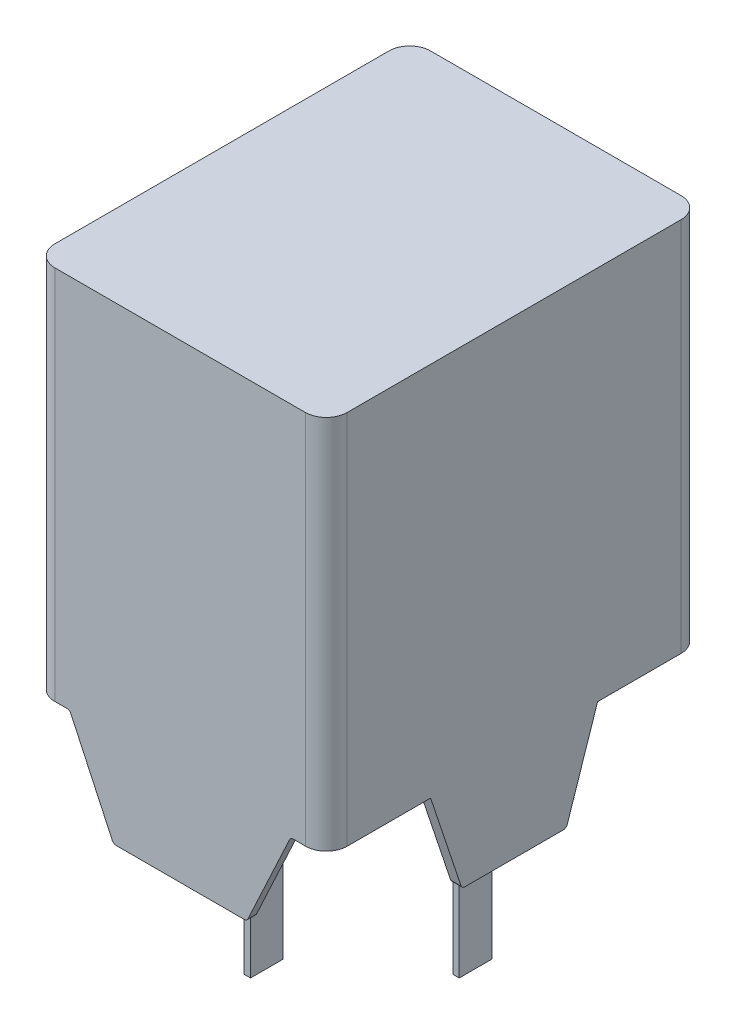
ISO-10303-21;
HEADER;
FILE_DESCRIPTION(('STEP AP214'),'2;1');
FILE_NAME('part.step','',(''),(''),'','','');
FILE_SCHEMA(('AUTOMOTIVE_DESIGN { 1 0 10303 214 1 1 1 1 }'));
ENDSEC;
DATA;
#1=APPLICATION_CONTEXT('core data for automotive mechanical design processes');
#2=APPLICATION_PROTOCOL_DEFINITION('international standard','automotive_design',2000,#1);
#3=PRODUCT_CONTEXT('',#1,'mechanical');
#4=PRODUCT('Part','Part','',(#3));
#5=PRODUCT_RELATED_PRODUCT_CATEGORY('part','',(#4));
#6=PRODUCT_DEFINITION_FORMATION('','',#4);
#7=PRODUCT_DEFINITION_CONTEXT('part definition',#1,'design');
#8=PRODUCT_DEFINITION('design','',#6,#7);
#9=PRODUCT_DEFINITION_SHAPE('','',#8);
#10=(LENGTH_UNIT() NAMED_UNIT(*) SI_UNIT(.MILLI.,.METRE.));
#11=(NAMED_UNIT(*) PLANE_ANGLE_UNIT() SI_UNIT($,.RADIAN.));
#12=(NAMED_UNIT(*) SI_UNIT($,.STERADIAN.) SOLID_ANGLE_UNIT());
#13=UNCERTAINTY_MEASURE_WITH_UNIT(LENGTH_MEASURE(1.E-05),#10,'distance_accuracy_value','');
#14=(GEOMETRIC_REPRESENTATION_CONTEXT(3) GLOBAL_UNCERTAINTY_ASSIGNED_CONTEXT((#13)) GLOBAL_UNIT_ASSIGNED_CONTEXT((#10,
#11,#12)) REPRESENTATION_CONTEXT('',''));
#15=CARTESIAN_POINT('',(0.,0.,0.));
#16=DIRECTION('',(0.,0.,1.));
#17=DIRECTION('',(1.,0.,0.));
#18=AXIS2_PLACEMENT_3D('',#15,#16,#17);
#19=CARTESIAN_POINT('',(7.,-6.75,15.));
#20=DIRECTION('',(0.,1.,0.));
#21=DIRECTION('',(0.,0.,1.));
#22=AXIS2_PLACEMENT_3D('',#19,#20,#21);
#23=PLANE('',#22);
#24=DIRECTION('',(0.,0.,-1.));
#25=VECTOR('',#24,1.);
#26=CARTESIAN_POINT('',(-5.15,-6.75,9.77948756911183));
#27=LINE('',#26,#25);
#28=CARTESIAN_POINT('',(-5.15,-6.75,9.77948756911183));
#29=VERTEX_POINT('',#28);
#30=CARTESIAN_POINT('',(-5.15,-6.75,8.22051243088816));
#31=VERTEX_POINT('',#30);
#32=EDGE_CURVE('E370',#29,#31,#27,.T.);
#33=ORIENTED_EDGE('',*,*,#32,.F.);
#34=DIRECTION('',(-1.,0.,0.));
#35=VECTOR('',#34,1.);
#36=CARTESIAN_POINT('',(-4.85,-6.75,9.77948756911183));
#37=LINE('',#36,#35);
#38=CARTESIAN_POINT('',(-4.85,-6.75,9.77948756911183));
#39=VERTEX_POINT('',#38);
#40=EDGE_CURVE('E360',#39,#29,#37,.T.);
#41=ORIENTED_EDGE('',*,*,#40,.F.);
#42=DIRECTION('',(0.,0.,1.));
#43=VECTOR('',#42,1.);
#44=CARTESIAN_POINT('',(-4.85,-6.75,9.77948756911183));
#45=LINE('',#44,#43);
#46=CARTESIAN_POINT('',(-4.85,-6.75,8.22051243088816));
#47=VERTEX_POINT('',#46);
#48=EDGE_CURVE('E363',#47,#39,#45,.T.);
#49=ORIENTED_EDGE('',*,*,#48,.F.);
#50=DIRECTION('',(1.,0.,0.));
#51=VECTOR('',#50,1.);
#52=CARTESIAN_POINT('',(-4.85,-6.75,8.22051243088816));
#53=LINE('',#52,#51);
#54=EDGE_CURVE('E367',#31,#47,#53,.T.);
#55=ORIENTED_EDGE('',*,*,#54,.F.);
#56=EDGE_LOOP('',(#33,#41,#49,#55));
#57=FACE_BOUND('',#56,.T.);
#58=DIRECTION('',(-1.,0.,0.));
#59=VECTOR('',#58,1.);
#60=CARTESIAN_POINT('',(7.,-6.75,0.));
#61=LINE('',#60,#59);
#62=CARTESIAN_POINT('',(6.,-6.75,0.));
#63=VERTEX_POINT('',#62);
#64=CARTESIAN_POINT('',(-6.,-6.75,0.));
#65=VERTEX_POINT('',#64);
#66=EDGE_CURVE('E452',#63,#65,#61,.T.);
#67=ORIENTED_EDGE('',*,*,#66,.F.);
#68=CARTESIAN_POINT('',(6.,-6.75,1.));
#69=DIRECTION('',(0.,1.,0.));
#70=DIRECTION('',(0.,0.,1.));
#71=AXIS2_PLACEMENT_3D('',#68,#69,#70);
#72=CIRCLE('',#71,1.);
#73=CARTESIAN_POINT('',(7.,-6.74999999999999,1.));
#74=VERTEX_POINT('',#73);
#75=EDGE_CURVE('E623',#63,#74,#72,.F.);
#76=ORIENTED_EDGE('',*,*,#75,.T.);
#77=DIRECTION('',(0.,0.,-1.));
#78=VECTOR('',#77,1.);
#79=CARTESIAN_POINT('',(7.,-6.74999999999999,0.));
#80=LINE('',#79,#78);
#81=CARTESIAN_POINT('',(7.,-6.74999999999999,5.));
#82=VERTEX_POINT('',#81);
#83=EDGE_CURVE('E439',#82,#74,#80,.T.);
#84=ORIENTED_EDGE('',*,*,#83,.F.);
#85=DIRECTION('',(-1.,0.,0.));
#86=VECTOR('',#85,1.);
#87=CARTESIAN_POINT('',(7.,-6.74999999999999,5.));
#88=LINE('',#87,#86);
#89=CARTESIAN_POINT('',(6.5,-6.74999999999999,5.));
#90=VERTEX_POINT('',#89);
#91=EDGE_CURVE('E456',#82,#90,#88,.T.);
#92=ORIENTED_EDGE('',*,*,#91,.T.);
#93=DIRECTION('',(0.,0.,-1.));
#94=VECTOR('',#93,1.);
#95=CARTESIAN_POINT('',(6.5,-6.74999999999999,17.5));
#96=LINE('',#95,#94);
#97=CARTESIAN_POINT('',(6.5,-6.74999999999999,12.9999999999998));
#98=VERTEX_POINT('',#97);
#99=EDGE_CURVE('E412',#98,#90,#96,.T.);
#100=ORIENTED_EDGE('',*,*,#99,.F.);
#101=DIRECTION('',(-1.,0.,0.));
#102=VECTOR('',#101,1.);
#103=CARTESIAN_POINT('',(7.,-6.75,12.9999999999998));
#104=LINE('',#103,#102);
#105=CARTESIAN_POINT('',(7.,-6.75,12.9999999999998));
#106=VERTEX_POINT('',#105);
#107=EDGE_CURVE('E487',#106,#98,#104,.T.);
#108=ORIENTED_EDGE('',*,*,#107,.F.);
#109=DIRECTION('',(0.,0.,-1.));
#110=VECTOR('',#109,1.);
#111=CARTESIAN_POINT('',(7.,-6.74999999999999,0.));
#112=LINE('',#111,#110);
#113=CARTESIAN_POINT('',(7.,-6.75,15.));
#114=VERTEX_POINT('',#113);
#115=EDGE_CURVE('E469',#114,#106,#112,.T.);
#116=ORIENTED_EDGE('',*,*,#115,.F.);
#117=DIRECTION('',(-1.,0.,0.));
#118=VECTOR('',#117,1.);
#119=CARTESIAN_POINT('',(7.,-6.75,15.));
#120=LINE('',#119,#118);
#121=CARTESIAN_POINT('',(5.35595267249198,-6.75,15.));
#122=VERTEX_POINT('',#121);
#123=EDGE_CURVE('E491',#114,#122,#120,.T.);
#124=ORIENTED_EDGE('',*,*,#123,.T.);
#125=DIRECTION('',(0.,0.,1.));
#126=VECTOR('',#125,1.);
#127=CARTESIAN_POINT('',(5.35595267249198,-6.75,15.));
#128=LINE('',#127,#126);
#129=CARTESIAN_POINT('',(5.35595267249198,-6.75,17.5865817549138));
#130=VERTEX_POINT('',#129);
#131=EDGE_CURVE('E503',#122,#130,#128,.T.);
#132=ORIENTED_EDGE('',*,*,#131,.T.);
#133=DIRECTION('',(-1.,0.,0.));
#134=VECTOR('',#133,1.);
#135=CARTESIAN_POINT('',(7.,-6.75,17.5865817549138));
#136=LINE('',#135,#134);
#137=CARTESIAN_POINT('',(-5.35595267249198,-6.75,17.5865817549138));
#138=VERTEX_POINT('',#137);
#139=EDGE_CURVE('E497',#130,#138,#136,.T.);
#140=ORIENTED_EDGE('',*,*,#139,.T.);
#141=DIRECTION('',(0.,0.,1.));
#142=VECTOR('',#141,1.);
#143=CARTESIAN_POINT('',(-5.35595267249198,-6.75,15.));
#144=LINE('',#143,#142);
#145=CARTESIAN_POINT('',(-5.35595267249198,-6.75,15.));
#146=VERTEX_POINT('',#145);
#147=EDGE_CURVE('E500',#138,#146,#144,.F.);
#148=ORIENTED_EDGE('',*,*,#147,.T.);
#149=CARTESIAN_POINT('',(-7.,-6.75,15.));
#150=VERTEX_POINT('',#149);
#151=EDGE_CURVE('E493',#146,#150,#120,.T.);
#152=ORIENTED_EDGE('',*,*,#151,.T.);
#153=DIRECTION('',(0.,0.,-1.));
#154=VECTOR('',#153,1.);
#155=CARTESIAN_POINT('',(-7.,-6.74999999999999,0.));
#156=LINE('',#155,#154);
#157=CARTESIAN_POINT('',(-7.,-6.75,12.9999999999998));
#158=VERTEX_POINT('',#157);
#159=EDGE_CURVE('E479',#150,#158,#156,.T.);
#160=ORIENTED_EDGE('',*,*,#159,.T.);
#161=CARTESIAN_POINT('',(-6.5,-6.74999999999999,12.9999999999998));
#162=VERTEX_POINT('',#161);
#163=EDGE_CURVE('E490',#162,#158,#104,.T.);
#164=ORIENTED_EDGE('',*,*,#163,.F.);
#165=DIRECTION('',(0.,0.,-1.));
#166=VECTOR('',#165,1.);
#167=CARTESIAN_POINT('',(-6.5,-6.74999999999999,17.5));
#168=LINE('',#167,#166);
#169=CARTESIAN_POINT('',(-6.5,-6.75,5.));
#170=VERTEX_POINT('',#169);
#171=EDGE_CURVE('E415',#162,#170,#168,.T.);
#172=ORIENTED_EDGE('',*,*,#171,.T.);
#173=CARTESIAN_POINT('',(-7.,-6.74999999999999,5.));
#174=VERTEX_POINT('',#173);
#175=EDGE_CURVE('E459',#170,#174,#88,.T.);
#176=ORIENTED_EDGE('',*,*,#175,.T.);
#177=DIRECTION('',(0.,0.,-1.));
#178=VECTOR('',#177,1.);
#179=CARTESIAN_POINT('',(-7.,-6.74999999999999,0.));
#180=LINE('',#179,#178);
#181=CARTESIAN_POINT('',(-7.,-6.74999999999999,1.));
#182=VERTEX_POINT('',#181);
#183=EDGE_CURVE('E437',#174,#182,#180,.T.);
#184=ORIENTED_EDGE('',*,*,#183,.T.);
#185=CARTESIAN_POINT('',(-6.,-6.75,1.));
#186=DIRECTION('',(0.,1.,0.));
#187=DIRECTION('',(0.,0.,1.));
#188=AXIS2_PLACEMENT_3D('',#185,#186,#187);
#189=CIRCLE('',#188,1.);
#190=EDGE_CURVE('E621',#182,#65,#189,.F.);
#191=ORIENTED_EDGE('',*,*,#190,.T.);
#192=EDGE_LOOP('',(#67,#76,#84,#92,#100,#108,#116,#124,#132,#140,#148,#152,#160,#164,#172,#176,
#184,#191));
#193=FACE_BOUND('',#192,.T.);
#194=DIRECTION('',(0.,0.,-1.));
#195=VECTOR('',#194,1.);
#196=CARTESIAN_POINT('',(4.85,-6.75,9.77948756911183));
#197=LINE('',#196,#195);
#198=CARTESIAN_POINT('',(4.85,-6.75,9.77948756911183));
#199=VERTEX_POINT('',#198);
#200=CARTESIAN_POINT('',(4.85,-6.75,8.22051243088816));
#201=VERTEX_POINT('',#200);
#202=EDGE_CURVE('E350',#199,#201,#197,.T.);
#203=ORIENTED_EDGE('',*,*,#202,.F.);
#204=DIRECTION('',(-1.,0.,0.));
#205=VECTOR('',#204,1.);
#206=CARTESIAN_POINT('',(5.15,-6.75,9.77948756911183));
#207=LINE('',#206,#205);
#208=CARTESIAN_POINT('',(5.15,-6.75,9.77948756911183));
#209=VERTEX_POINT('',#208);
#210=EDGE_CURVE('E393',#209,#199,#207,.T.);
#211=ORIENTED_EDGE('',*,*,#210,.F.);
#212=DIRECTION('',(0.,0.,1.));
#213=VECTOR('',#212,1.);
#214=CARTESIAN_POINT('',(5.15,-6.75,9.77948756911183));
#215=LINE('',#214,#213);
#216=CARTESIAN_POINT('',(5.15,-6.75,8.22051243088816));
#217=VERTEX_POINT('',#216);
#218=EDGE_CURVE('E396',#217,#209,#215,.T.);
#219=ORIENTED_EDGE('',*,*,#218,.F.);
#220=DIRECTION('',(1.,0.,0.));
#221=VECTOR('',#220,1.);
#222=CARTESIAN_POINT('',(5.15,-6.75,8.22051243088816));
#223=LINE('',#222,#221);
#224=EDGE_CURVE('E400',#201,#217,#223,.T.);
#225=ORIENTED_EDGE('',*,*,#224,.F.);
#226=EDGE_LOOP('',(#203,#211,#219,#225));
#227=FACE_BOUND('',#226,.T.);
#228=DIRECTION('',(0.,0.,-1.));
#229=VECTOR('',#228,1.);
#230=CARTESIAN_POINT('',(-0.15,-6.75,14.7794875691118));
#231=LINE('',#230,#229);
#232=CARTESIAN_POINT('',(-0.15,-6.75,14.7794875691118));
#233=VERTEX_POINT('',#232);
#234=CARTESIAN_POINT('',(-0.15,-6.75,13.2205124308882));
#235=VERTEX_POINT('',#234);
#236=EDGE_CURVE('E336',#233,#235,#231,.T.);
#237=ORIENTED_EDGE('',*,*,#236,.F.);
#238=DIRECTION('',(-1.,0.,0.));
#239=VECTOR('',#238,1.);
#240=CARTESIAN_POINT('',(0.15,-6.75,14.7794875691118));
#241=LINE('',#240,#239);
#242=CARTESIAN_POINT('',(0.150000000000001,-6.75,14.7794875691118));
#243=VERTEX_POINT('',#242);
#244=EDGE_CURVE('E333',#243,#233,#241,.T.);
#245=ORIENTED_EDGE('',*,*,#244,.F.);
#246=DIRECTION('',(0.,0.,1.));
#247=VECTOR('',#246,1.);
#248=CARTESIAN_POINT('',(0.15,-6.75,14.7794875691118));
#249=LINE('',#248,#247);
#250=CARTESIAN_POINT('',(0.15,-6.75,13.2205124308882));
#251=VERTEX_POINT('',#250);
#252=EDGE_CURVE('E62',#251,#243,#249,.T.);
#253=ORIENTED_EDGE('',*,*,#252,.F.);
#254=DIRECTION('',(1.,0.,0.));
#255=VECTOR('',#254,1.);
#256=CARTESIAN_POINT('',(0.15,-6.75,13.2205124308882));
#257=LINE('',#256,#255);
#258=EDGE_CURVE('E57',#235,#251,#257,.T.);
#259=ORIENTED_EDGE('',*,*,#258,.F.);
#260=EDGE_LOOP('',(#237,#245,#253,#259));
#261=FACE_BOUND('',#260,.T.);
#262=ADVANCED_FACE('F42',(#57,#193,#227,#261),#23,.F.);
#263=CARTESIAN_POINT('',(-7.,-11.25,18.));
#264=DIRECTION('',(0.,1.,0.));
#265=DIRECTION('',(0.,0.,1.));
#266=AXIS2_PLACEMENT_3D('',#263,#264,#265);
#267=PLANE('',#266);
#268=DIRECTION('',(-1.,0.,0.));
#269=VECTOR('',#268,1.);
#270=CARTESIAN_POINT('',(7.,-11.25,11.3558481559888));
#271=LINE('',#270,#269);
#272=CARTESIAN_POINT('',(7.,-11.25,11.3558481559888));
#273=VERTEX_POINT('',#272);
#274=CARTESIAN_POINT('',(6.5,-11.25,11.3558481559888));
#275=VERTEX_POINT('',#274);
#276=EDGE_CURVE('E494',#273,#275,#271,.T.);
#277=ORIENTED_EDGE('',*,*,#276,.T.);
#278=DIRECTION('',(0.,0.,-1.));
#279=VECTOR('',#278,1.);
#280=CARTESIAN_POINT('',(6.5,-11.25,17.5));
#281=LINE('',#280,#279);
#282=CARTESIAN_POINT('',(6.5,-11.25,6.64415184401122));
#283=VERTEX_POINT('',#282);
#284=EDGE_CURVE('E337',#275,#283,#281,.T.);
#285=ORIENTED_EDGE('',*,*,#284,.T.);
#286=DIRECTION('',(-1.,0.,0.));
#287=VECTOR('',#286,1.);
#288=CARTESIAN_POINT('',(7.,-11.25,6.64415184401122));
#289=LINE('',#288,#287);
#290=CARTESIAN_POINT('',(7.,-11.25,6.64415184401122));
#291=VERTEX_POINT('',#290);
#292=EDGE_CURVE('E464',#291,#283,#289,.T.);
#293=ORIENTED_EDGE('',*,*,#292,.F.);
#294=DIRECTION('',(0.,0.,-1.));
#295=VECTOR('',#294,1.);
#296=CARTESIAN_POINT('',(7.,-11.25,18.));
#297=LINE('',#296,#295);
#298=EDGE_CURVE('E581',#273,#291,#297,.T.);
#299=ORIENTED_EDGE('',*,*,#298,.F.);
#300=EDGE_LOOP('',(#277,#285,#293,#299));
#301=FACE_BOUND('',#300,.T.);
#302=ADVANCED_FACE('F738',(#301),#267,.F.);
#303=CARTESIAN_POINT('',(7.,-11.05,11.3558481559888));
#304=DIRECTION('',(-1.,0.,0.));
#305=DIRECTION('',(0.,0.,1.));
#306=AXIS2_PLACEMENT_3D('',#303,#304,#305);
#307=CYLINDRICAL_SURFACE('',#306,0.2);
#308=CARTESIAN_POINT('',(6.5,-11.05,11.3558481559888));
#309=DIRECTION('',(1.,0.,0.));
#310=DIRECTION('',(0.,1.,0.));
#311=AXIS2_PLACEMENT_3D('',#308,#309,#310);
#312=CIRCLE('',#311,0.2);
#313=CARTESIAN_POINT('',(6.5,-11.1132455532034,11.5455848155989));
#314=VERTEX_POINT('',#313);
#315=EDGE_CURVE('E430',#275,#314,#312,.F.);
#316=ORIENTED_EDGE('',*,*,#315,.F.);
#317=ORIENTED_EDGE('',*,*,#276,.F.);
#318=CARTESIAN_POINT('',(7.,-11.05,11.3558481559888));
#319=DIRECTION('',(-1.,0.,0.));
#320=DIRECTION('',(0.,0.,1.));
#321=AXIS2_PLACEMENT_3D('',#318,#319,#320);
#322=CIRCLE('',#321,0.2);
#323=CARTESIAN_POINT('',(7.,-11.1132455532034,11.5455848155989));
#324=VERTEX_POINT('',#323);
#325=EDGE_CURVE('E467',#273,#324,#322,.T.);
#326=ORIENTED_EDGE('',*,*,#325,.T.);
#327=DIRECTION('',(-1.,0.,0.));
#328=VECTOR('',#327,1.);
#329=CARTESIAN_POINT('',(7.,-11.1132455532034,11.5455848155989));
#330=LINE('',#329,#328);
#331=EDGE_CURVE('E447',#324,#314,#330,.T.);
#332=ORIENTED_EDGE('',*,*,#331,.T.);
#333=EDGE_LOOP('',(#316,#317,#326,#332));
#334=FACE_BOUND('',#333,.T.);
#335=ADVANCED_FACE('F734',(#334),#307,.T.);
#336=CARTESIAN_POINT('',(7.,-4.57499999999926,13.7249999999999));
#337=DIRECTION('',(0.,0.316227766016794,-0.948683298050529));
#338=DIRECTION('',(0.,0.948683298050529,0.316227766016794));
#339=AXIS2_PLACEMENT_3D('',#336,#337,#338);
#340=PLANE('',#339);
#341=ORIENTED_EDGE('',*,*,#107,.T.);
#342=DIRECTION('',(0.,-0.948683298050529,-0.316227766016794));
#343=VECTOR('',#342,1.);
#344=CARTESIAN_POINT('',(6.5,-4.57499999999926,13.7249999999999));
#345=LINE('',#344,#343);
#346=EDGE_CURVE('E427',#98,#314,#345,.T.);
#347=ORIENTED_EDGE('',*,*,#346,.T.);
#348=ORIENTED_EDGE('',*,*,#331,.F.);
#349=DIRECTION('',(0.,-0.948683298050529,-0.316227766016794));
#350=VECTOR('',#349,1.);
#351=CARTESIAN_POINT('',(7.,-4.57499999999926,13.7249999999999));
#352=LINE('',#351,#350);
#353=EDGE_CURVE('E473',#106,#324,#352,.T.);
#354=ORIENTED_EDGE('',*,*,#353,.F.);
#355=EDGE_LOOP('',(#341,#347,#348,#354));
#356=FACE_BOUND('',#355,.T.);
#357=ADVANCED_FACE('F731',(#356),#340,.F.);
#358=CARTESIAN_POINT('',(7.,0.825,2.475));
#359=DIRECTION('',(0.,-0.316227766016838,-0.948683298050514));
#360=DIRECTION('',(0.,0.948683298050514,-0.316227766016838));
#361=AXIS2_PLACEMENT_3D('',#358,#359,#360);
#362=PLANE('',#361);
#363=DIRECTION('',(0.,-0.948683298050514,0.316227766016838));
#364=VECTOR('',#363,1.);
#365=CARTESIAN_POINT('',(6.5,0.825,2.475));
#366=LINE('',#365,#364);
#367=CARTESIAN_POINT('',(6.5,-11.1132455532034,6.45441518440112));
#368=VERTEX_POINT('',#367);
#369=EDGE_CURVE('E425',#90,#368,#366,.T.);
#370=ORIENTED_EDGE('',*,*,#369,.F.);
#371=ORIENTED_EDGE('',*,*,#91,.F.);
#372=DIRECTION('',(0.,-0.948683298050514,0.316227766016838));
#373=VECTOR('',#372,1.);
#374=CARTESIAN_POINT('',(7.,0.825,2.475));
#375=LINE('',#374,#373);
#376=CARTESIAN_POINT('',(7.,-11.1132455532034,6.45441518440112));
#377=VERTEX_POINT('',#376);
#378=EDGE_CURVE('E436',#82,#377,#375,.T.);
#379=ORIENTED_EDGE('',*,*,#378,.T.);
#380=DIRECTION('',(-1.,0.,0.));
#381=VECTOR('',#380,1.);
#382=CARTESIAN_POINT('',(7.,-11.1132455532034,6.45441518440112));
#383=LINE('',#382,#381);
#384=EDGE_CURVE('E460',#377,#368,#383,.T.);
#385=ORIENTED_EDGE('',*,*,#384,.T.);
#386=EDGE_LOOP('',(#370,#371,#379,#385));
#387=FACE_BOUND('',#386,.T.);
#388=ADVANCED_FACE('F744',(#387),#362,.T.);
#389=CARTESIAN_POINT('',(7.,-11.05,6.64415184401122));
#390=DIRECTION('',(-1.,0.,0.));
#391=DIRECTION('',(0.,0.,1.));
#392=AXIS2_PLACEMENT_3D('',#389,#390,#391);
#393=CYLINDRICAL_SURFACE('',#392,0.2);
#394=ORIENTED_EDGE('',*,*,#292,.T.);
#395=CARTESIAN_POINT('',(6.5,-11.05,6.64415184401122));
#396=DIRECTION('',(1.,0.,0.));
#397=DIRECTION('',(0.,1.,0.));
#398=AXIS2_PLACEMENT_3D('',#395,#396,#397);
#399=CIRCLE('',#398,0.2);
#400=EDGE_CURVE('E601',#283,#368,#399,.T.);
#401=ORIENTED_EDGE('',*,*,#400,.T.);
#402=ORIENTED_EDGE('',*,*,#384,.F.);
#403=CARTESIAN_POINT('',(7.,-11.05,6.64415184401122));
#404=DIRECTION('',(-1.,0.,0.));
#405=DIRECTION('',(0.,0.,1.));
#406=AXIS2_PLACEMENT_3D('',#403,#404,#405);
#407=CIRCLE('',#406,0.2);
#408=EDGE_CURVE('E433',#291,#377,#407,.F.);
#409=ORIENTED_EDGE('',*,*,#408,.F.);
#410=EDGE_LOOP('',(#394,#401,#402,#409));
#411=FACE_BOUND('',#410,.T.);
#412=ADVANCED_FACE('F740',(#411),#393,.T.);
#413=CARTESIAN_POINT('',(7.,-11.25,18.));
#414=DIRECTION('',(-1.,0.,0.));
#415=DIRECTION('',(0.,0.,1.));
#416=AXIS2_PLACEMENT_3D('',#413,#414,#415);
#417=PLANE('',#416);
#418=ORIENTED_EDGE('',*,*,#83,.T.);
#419=DIRECTION('',(0.,1.,0.));
#420=VECTOR('',#419,1.);
#421=CARTESIAN_POINT('',(7.,11.25,1.));
#422=LINE('',#421,#420);
#423=CARTESIAN_POINT('',(7.,11.25,1.));
#424=VERTEX_POINT('',#423);
#425=EDGE_CURVE('E606',#74,#424,#422,.T.);
#426=ORIENTED_EDGE('',*,*,#425,.T.);
#427=DIRECTION('',(0.,0.,-1.));
#428=VECTOR('',#427,1.);
#429=CARTESIAN_POINT('',(7.,11.25,18.));
#430=LINE('',#429,#428);
#431=CARTESIAN_POINT('',(7.,11.25,17.));
#432=VERTEX_POINT('',#431);
#433=EDGE_CURVE('E592',#432,#424,#430,.T.);
#434=ORIENTED_EDGE('',*,*,#433,.F.);
#435=DIRECTION('',(0.,1.,0.));
#436=VECTOR('',#435,1.);
#437=CARTESIAN_POINT('',(7.,-11.25,17.));
#438=LINE('',#437,#436);
#439=CARTESIAN_POINT('',(7.,-6.75,17.));
#440=VERTEX_POINT('',#439);
#441=EDGE_CURVE('E604',#432,#440,#438,.F.);
#442=ORIENTED_EDGE('',*,*,#441,.T.);
#443=DIRECTION('',(0.,0.,1.));
#444=VECTOR('',#443,1.);
#445=CARTESIAN_POINT('',(7.,-6.75,15.));
#446=LINE('',#445,#444);
#447=EDGE_CURVE('E567',#114,#440,#446,.T.);
#448=ORIENTED_EDGE('',*,*,#447,.F.);
#449=ORIENTED_EDGE('',*,*,#115,.T.);
#450=ORIENTED_EDGE('',*,*,#353,.T.);
#451=ORIENTED_EDGE('',*,*,#325,.F.);
#452=ORIENTED_EDGE('',*,*,#298,.T.);
#453=ORIENTED_EDGE('',*,*,#408,.T.);
#454=ORIENTED_EDGE('',*,*,#378,.F.);
#455=EDGE_LOOP('',(#418,#426,#434,#442,#448,#449,#450,#451,#452,#453,#454));
#456=FACE_BOUND('',#455,.T.);
#457=ADVANCED_FACE('F704',(#456),#417,.F.);
#458=CARTESIAN_POINT('',(-7.,-11.25,18.));
#459=DIRECTION('',(1.,0.,0.));
#460=DIRECTION('',(0.,0.,-1.));
#461=AXIS2_PLACEMENT_3D('',#458,#459,#460);
#462=PLANE('',#461);
#463=DIRECTION('',(0.,0.,1.));
#464=VECTOR('',#463,1.);
#465=CARTESIAN_POINT('',(-7.,-6.75,15.));
#466=LINE('',#465,#464);
#467=CARTESIAN_POINT('',(-7.,-6.75,17.));
#468=VERTEX_POINT('',#467);
#469=EDGE_CURVE('E543',#150,#468,#466,.T.);
#470=ORIENTED_EDGE('',*,*,#469,.T.);
#471=DIRECTION('',(0.,-1.,0.));
#472=VECTOR('',#471,1.);
#473=CARTESIAN_POINT('',(-7.,-11.25,17.));
#474=LINE('',#473,#472);
#475=CARTESIAN_POINT('',(-7.,11.25,17.));
#476=VERTEX_POINT('',#475);
#477=EDGE_CURVE('E12',#468,#476,#474,.F.);
#478=ORIENTED_EDGE('',*,*,#477,.T.);
#479=DIRECTION('',(0.,0.,-1.));
#480=VECTOR('',#479,1.);
#481=CARTESIAN_POINT('',(-7.,11.25,18.));
#482=LINE('',#481,#480);
#483=CARTESIAN_POINT('',(-7.,11.25,1.));
#484=VERTEX_POINT('',#483);
#485=EDGE_CURVE('E589',#476,#484,#482,.T.);
#486=ORIENTED_EDGE('',*,*,#485,.T.);
#487=DIRECTION('',(0.,-1.,0.));
#488=VECTOR('',#487,1.);
#489=CARTESIAN_POINT('',(-7.,-6.75,1.));
#490=LINE('',#489,#488);
#491=EDGE_CURVE('E50',#484,#182,#490,.T.);
#492=ORIENTED_EDGE('',*,*,#491,.T.);
#493=ORIENTED_EDGE('',*,*,#183,.F.);
#494=DIRECTION('',(0.,-0.948683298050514,0.316227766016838));
#495=VECTOR('',#494,1.);
#496=CARTESIAN_POINT('',(-7.,0.825,2.475));
#497=LINE('',#496,#495);
#498=CARTESIAN_POINT('',(-7.,-11.1132455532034,6.45441518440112));
#499=VERTEX_POINT('',#498);
#500=EDGE_CURVE('E446',#174,#499,#497,.T.);
#501=ORIENTED_EDGE('',*,*,#500,.T.);
#502=CARTESIAN_POINT('',(-7.,-11.05,6.64415184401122));
#503=DIRECTION('',(-1.,0.,0.));
#504=DIRECTION('',(0.,0.,1.));
#505=AXIS2_PLACEMENT_3D('',#502,#503,#504);
#506=CIRCLE('',#505,0.2);
#507=CARTESIAN_POINT('',(-7.,-11.25,6.64415184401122));
#508=VERTEX_POINT('',#507);
#509=EDGE_CURVE('E443',#508,#499,#506,.F.);
#510=ORIENTED_EDGE('',*,*,#509,.F.);
#511=DIRECTION('',(0.,0.,-1.));
#512=VECTOR('',#511,1.);
#513=CARTESIAN_POINT('',(-7.,-11.25,18.));
#514=LINE('',#513,#512);
#515=CARTESIAN_POINT('',(-7.,-11.25,11.3558481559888));
#516=VERTEX_POINT('',#515);
#517=EDGE_CURVE('E586',#516,#508,#514,.T.);
#518=ORIENTED_EDGE('',*,*,#517,.F.);
#519=CARTESIAN_POINT('',(-7.,-11.05,11.3558481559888));
#520=DIRECTION('',(-1.,0.,0.));
#521=DIRECTION('',(0.,0.,1.));
#522=AXIS2_PLACEMENT_3D('',#519,#520,#521);
#523=CIRCLE('',#522,0.2);
#524=CARTESIAN_POINT('',(-7.,-11.1132455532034,11.5455848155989));
#525=VERTEX_POINT('',#524);
#526=EDGE_CURVE('E432',#516,#525,#523,.T.);
#527=ORIENTED_EDGE('',*,*,#526,.T.);
#528=DIRECTION('',(0.,-0.948683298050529,-0.316227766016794));
#529=VECTOR('',#528,1.);
#530=CARTESIAN_POINT('',(-7.,-4.57499999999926,13.7249999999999));
#531=LINE('',#530,#529);
#532=EDGE_CURVE('E470',#158,#525,#531,.T.);
#533=ORIENTED_EDGE('',*,*,#532,.F.);
#534=ORIENTED_EDGE('',*,*,#159,.F.);
#535=EDGE_LOOP('',(#470,#478,#486,#492,#493,#501,#510,#518,#527,#533,#534));
#536=FACE_BOUND('',#535,.T.);
#537=ADVANCED_FACE('F638',(#536),#462,.F.);
#538=CARTESIAN_POINT('',(0.,0.,15.));
#539=DIRECTION('',(0.,0.,1.));
#540=DIRECTION('',(1.,0.,0.));
#541=AXIS2_PLACEMENT_3D('',#538,#539,#540);
#542=PLANE('',#541);
#543=ORIENTED_EDGE('',*,*,#123,.F.);
#544=DIRECTION('',(0.999975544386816,-0.00699361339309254,0.));
#545=VECTOR('',#544,1.);
#546=CARTESIAN_POINT('',(-0.046863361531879,-6.70071575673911,15.));
#547=LINE('',#546,#545);
#548=CARTESIAN_POINT('',(5.42286656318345,-6.73896986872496,15.));
#549=VERTEX_POINT('',#548);
#550=EDGE_CURVE('E550',#549,#114,#547,.T.);
#551=ORIENTED_EDGE('',*,*,#550,.F.);
#552=CARTESIAN_POINT('',(5.42146784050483,-6.93896497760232,15.));
#553=DIRECTION('',(0.,0.,1.));
#554=DIRECTION('',(1.,0.,0.));
#555=AXIS2_PLACEMENT_3D('',#552,#553,#554);
#556=CIRCLE('',#555,0.2);
#557=EDGE_CURVE('E548',#122,#549,#556,.F.);
#558=ORIENTED_EDGE('',*,*,#557,.F.);
#559=EDGE_LOOP('',(#543,#551,#558));
#560=FACE_BOUND('',#559,.T.);
#561=ADVANCED_FACE('F724',(#560),#542,.T.);
#562=CARTESIAN_POINT('',(-6.5,-11.25,6.64415184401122));
#563=VERTEX_POINT('',#562);
#564=EDGE_CURVE('E442',#563,#508,#289,.T.);
#565=ORIENTED_EDGE('',*,*,#564,.F.);
#566=DIRECTION('',(0.,0.,-1.));
#567=VECTOR('',#566,1.);
#568=CARTESIAN_POINT('',(-6.5,-11.25,17.5));
#569=LINE('',#568,#567);
#570=CARTESIAN_POINT('',(-6.5,-11.25,11.3558481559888));
#571=VERTEX_POINT('',#570);
#572=EDGE_CURVE('E340',#571,#563,#569,.T.);
#573=ORIENTED_EDGE('',*,*,#572,.F.);
#574=EDGE_CURVE('E476',#571,#516,#271,.T.);
#575=ORIENTED_EDGE('',*,*,#574,.T.);
#576=ORIENTED_EDGE('',*,*,#517,.T.);
#577=EDGE_LOOP('',(#565,#573,#575,#576));
#578=FACE_BOUND('',#577,.T.);
#579=ADVANCED_FACE('F657',(#578),#267,.F.);
#580=CARTESIAN_POINT('',(0.,0.,18.));
#581=DIRECTION('',(0.,0.,-1.));
#582=DIRECTION('',(-1.,0.,0.));
#583=AXIS2_PLACEMENT_3D('',#580,#581,#582);
#584=PLANE('',#583);
#585=DIRECTION('',(0.999975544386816,-0.00699361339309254,0.));
#586=VECTOR('',#585,1.);
#587=CARTESIAN_POINT('',(-0.046863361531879,-6.70071575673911,18.));
#588=LINE('',#587,#586);
#589=CARTESIAN_POINT('',(5.42286656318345,-6.73896986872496,18.));
#590=VERTEX_POINT('',#589);
#591=CARTESIAN_POINT('',(6.,-6.74300621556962,18.));
#592=VERTEX_POINT('',#591);
#593=EDGE_CURVE('E551',#590,#592,#588,.T.);
#594=ORIENTED_EDGE('',*,*,#593,.T.);
#595=DIRECTION('',(0.,1.,0.));
#596=VECTOR('',#595,1.);
#597=CARTESIAN_POINT('',(6.,0.,18.));
#598=LINE('',#597,#596);
#599=CARTESIAN_POINT('',(6.,11.25,18.));
#600=VERTEX_POINT('',#599);
#601=EDGE_CURVE('E628',#592,#600,#598,.T.);
#602=ORIENTED_EDGE('',*,*,#601,.T.);
#603=DIRECTION('',(-1.,0.,0.));
#604=VECTOR('',#603,1.);
#605=CARTESIAN_POINT('',(-7.,11.25,18.));
#606=LINE('',#605,#604);
#607=CARTESIAN_POINT('',(-6.,11.25,18.));
#608=VERTEX_POINT('',#607);
#609=EDGE_CURVE('E575',#600,#608,#606,.T.);
#610=ORIENTED_EDGE('',*,*,#609,.T.);
#611=DIRECTION('',(0.,-1.,0.));
#612=VECTOR('',#611,1.);
#613=CARTESIAN_POINT('',(-6.,0.,18.));
#614=LINE('',#613,#612);
#615=CARTESIAN_POINT('',(-6.,-6.74300621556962,18.));
#616=VERTEX_POINT('',#615);
#617=EDGE_CURVE('E625',#608,#616,#614,.T.);
#618=ORIENTED_EDGE('',*,*,#617,.T.);
#619=DIRECTION('',(-0.999975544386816,-0.00699361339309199,0.));
#620=VECTOR('',#619,1.);
#621=CARTESIAN_POINT('',(0.0468633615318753,-6.70071575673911,18.));
#622=LINE('',#621,#620);
#623=CARTESIAN_POINT('',(-5.42286656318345,-6.73896986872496,18.));
#624=VERTEX_POINT('',#623);
#625=EDGE_CURVE('E527',#624,#616,#622,.T.);
#626=ORIENTED_EDGE('',*,*,#625,.F.);
#627=CARTESIAN_POINT('',(-5.42146784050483,-6.93896497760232,18.));
#628=DIRECTION('',(0.,0.,1.));
#629=DIRECTION('',(1.,0.,0.));
#630=AXIS2_PLACEMENT_3D('',#627,#628,#629);
#631=CIRCLE('',#630,0.2);
#632=CARTESIAN_POINT('',(-5.24012391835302,-6.85461818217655,18.));
#633=VERTEX_POINT('',#632);
#634=EDGE_CURVE('E524',#624,#633,#631,.F.);
#635=ORIENTED_EDGE('',*,*,#634,.T.);
#636=DIRECTION('',(0.42173397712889,-0.906719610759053,0.));
#637=VECTOR('',#636,1.);
#638=CARTESIAN_POINT('',(-6.9292859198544,-3.22295368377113,18.));
#639=LINE('',#638,#637);
#640=CARTESIAN_POINT('',(-3.24953394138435,-11.1343467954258,18.));
#641=VERTEX_POINT('',#640);
#642=EDGE_CURVE('E520',#633,#641,#639,.T.);
#643=ORIENTED_EDGE('',*,*,#642,.T.);
#644=CARTESIAN_POINT('',(-3.06819001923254,-11.05,18.));
#645=DIRECTION('',(0.,0.,1.));
#646=DIRECTION('',(1.,0.,0.));
#647=AXIS2_PLACEMENT_3D('',#644,#645,#646);
#648=CIRCLE('',#647,0.200000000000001);
#649=CARTESIAN_POINT('',(-3.06819001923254,-11.25,18.));
#650=VERTEX_POINT('',#649);
#651=EDGE_CURVE('E531',#650,#641,#648,.F.);
#652=ORIENTED_EDGE('',*,*,#651,.F.);
#653=DIRECTION('',(1.,0.,0.));
#654=VECTOR('',#653,1.);
#655=CARTESIAN_POINT('',(-7.,-11.25,18.));
#656=LINE('',#655,#654);
#657=CARTESIAN_POINT('',(3.06819001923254,-11.25,18.));
#658=VERTEX_POINT('',#657);
#659=EDGE_CURVE('E578',#650,#658,#656,.T.);
#660=ORIENTED_EDGE('',*,*,#659,.T.);
#661=CARTESIAN_POINT('',(3.06819001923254,-11.05,18.));
#662=DIRECTION('',(0.,0.,1.));
#663=DIRECTION('',(1.,0.,0.));
#664=AXIS2_PLACEMENT_3D('',#661,#662,#663);
#665=CIRCLE('',#664,0.200000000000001);
#666=CARTESIAN_POINT('',(3.24953394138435,-11.1343467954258,18.));
#667=VERTEX_POINT('',#666);
#668=EDGE_CURVE('E560',#658,#667,#665,.T.);
#669=ORIENTED_EDGE('',*,*,#668,.T.);
#670=DIRECTION('',(0.42173397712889,0.906719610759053,0.));
#671=VECTOR('',#670,1.);
#672=CARTESIAN_POINT('',(6.9292859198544,-3.22295368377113,18.));
#673=LINE('',#672,#671);
#674=CARTESIAN_POINT('',(5.24012391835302,-6.85461818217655,18.));
#675=VERTEX_POINT('',#674);
#676=EDGE_CURVE('E557',#667,#675,#673,.T.);
#677=ORIENTED_EDGE('',*,*,#676,.T.);
#678=CARTESIAN_POINT('',(5.42146784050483,-6.93896497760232,18.));
#679=DIRECTION('',(0.,0.,1.));
#680=DIRECTION('',(1.,0.,0.));
#681=AXIS2_PLACEMENT_3D('',#678,#679,#680);
#682=CIRCLE('',#681,0.2);
#683=EDGE_CURVE('E515',#675,#590,#682,.F.);
#684=ORIENTED_EDGE('',*,*,#683,.T.);
#685=EDGE_LOOP('',(#594,#602,#610,#618,#626,#635,#643,#652,#660,#669,#677,#684));
#686=FACE_BOUND('',#685,.T.);
#687=ADVANCED_FACE('F683',(#686),#584,.F.);
#688=CARTESIAN_POINT('',(-7.,11.25,18.));
#689=DIRECTION('',(0.,-1.,0.));
#690=DIRECTION('',(0.,0.,-1.));
#691=AXIS2_PLACEMENT_3D('',#688,#689,#690);
#692=PLANE('',#691);
#693=ORIENTED_EDGE('',*,*,#433,.T.);
#694=CARTESIAN_POINT('',(6.,11.25,1.));
#695=DIRECTION('',(0.,-1.,0.));
#696=DIRECTION('',(0.,0.,-1.));
#697=AXIS2_PLACEMENT_3D('',#694,#695,#696);
#698=CIRCLE('',#697,1.);
#699=CARTESIAN_POINT('',(6.,11.25,0.));
#700=VERTEX_POINT('',#699);
#701=EDGE_CURVE('E615',#424,#700,#698,.F.);
#702=ORIENTED_EDGE('',*,*,#701,.T.);
#703=DIRECTION('',(-1.,0.,0.));
#704=VECTOR('',#703,1.);
#705=CARTESIAN_POINT('',(-7.,11.25,0.));
#706=LINE('',#705,#704);
#707=CARTESIAN_POINT('',(-6.,11.25,0.));
#708=VERTEX_POINT('',#707);
#709=EDGE_CURVE('E538',#700,#708,#706,.T.);
#710=ORIENTED_EDGE('',*,*,#709,.T.);
#711=CARTESIAN_POINT('',(-6.,11.25,1.));
#712=DIRECTION('',(0.,-1.,0.));
#713=DIRECTION('',(0.,0.,-1.));
#714=AXIS2_PLACEMENT_3D('',#711,#712,#713);
#715=CIRCLE('',#714,1.);
#716=EDGE_CURVE('E609',#708,#484,#715,.F.);
#717=ORIENTED_EDGE('',*,*,#716,.T.);
#718=ORIENTED_EDGE('',*,*,#485,.F.);
#719=CARTESIAN_POINT('',(-6.,11.25,17.));
#720=DIRECTION('',(0.,-1.,0.));
#721=DIRECTION('',(0.,0.,-1.));
#722=AXIS2_PLACEMENT_3D('',#719,#720,#721);
#723=CIRCLE('',#722,1.);
#724=EDGE_CURVE('E611',#476,#608,#723,.F.);
#725=ORIENTED_EDGE('',*,*,#724,.T.);
#726=ORIENTED_EDGE('',*,*,#609,.F.);
#727=CARTESIAN_POINT('',(6.,11.25,17.));
#728=DIRECTION('',(0.,-1.,0.));
#729=DIRECTION('',(0.,0.,-1.));
#730=AXIS2_PLACEMENT_3D('',#727,#728,#729);
#731=CIRCLE('',#730,1.);
#732=EDGE_CURVE('E613',#600,#432,#731,.F.);
#733=ORIENTED_EDGE('',*,*,#732,.T.);
#734=EDGE_LOOP('',(#693,#702,#710,#717,#718,#725,#726,#733));
#735=FACE_BOUND('',#734,.T.);
#736=ADVANCED_FACE('F691',(#735),#692,.F.);
#737=DIRECTION('',(0.,0.,1.));
#738=VECTOR('',#737,1.);
#739=CARTESIAN_POINT('',(-3.06819001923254,-11.25,15.));
#740=LINE('',#739,#738);
#741=CARTESIAN_POINT('',(-3.06819001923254,-11.25,17.5865817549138));
#742=VERTEX_POINT('',#741);
#743=EDGE_CURVE('E541',#742,#650,#740,.T.);
#744=ORIENTED_EDGE('',*,*,#743,.F.);
#745=DIRECTION('',(-1.,0.,0.));
#746=VECTOR('',#745,1.);
#747=CARTESIAN_POINT('',(7.,-11.25,17.5865817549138));
#748=LINE('',#747,#746);
#749=CARTESIAN_POINT('',(3.06819001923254,-11.25,17.5865817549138));
#750=VERTEX_POINT('',#749);
#751=EDGE_CURVE('E455',#750,#742,#748,.T.);
#752=ORIENTED_EDGE('',*,*,#751,.F.);
#753=DIRECTION('',(0.,0.,1.));
#754=VECTOR('',#753,1.);
#755=CARTESIAN_POINT('',(3.06819001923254,-11.25,15.));
#756=LINE('',#755,#754);
#757=EDGE_CURVE('E570',#750,#658,#756,.T.);
#758=ORIENTED_EDGE('',*,*,#757,.T.);
#759=ORIENTED_EDGE('',*,*,#659,.F.);
#760=EDGE_LOOP('',(#744,#752,#758,#759));
#761=FACE_BOUND('',#760,.T.);
#762=ADVANCED_FACE('F768',(#761),#267,.F.);
#763=CARTESIAN_POINT('',(0.,0.,0.));
#764=DIRECTION('',(0.,0.,-1.));
#765=DIRECTION('',(-1.,0.,0.));
#766=AXIS2_PLACEMENT_3D('',#763,#764,#765);
#767=PLANE('',#766);
#768=ORIENTED_EDGE('',*,*,#709,.F.);
#769=DIRECTION('',(0.,1.,0.));
#770=VECTOR('',#769,1.);
#771=CARTESIAN_POINT('',(6.,-6.75,0.));
#772=LINE('',#771,#770);
#773=EDGE_CURVE('E619',#700,#63,#772,.F.);
#774=ORIENTED_EDGE('',*,*,#773,.T.);
#775=ORIENTED_EDGE('',*,*,#66,.T.);
#776=DIRECTION('',(0.,-1.,0.));
#777=VECTOR('',#776,1.);
#778=CARTESIAN_POINT('',(-6.,11.25,0.));
#779=LINE('',#778,#777);
#780=EDGE_CURVE('E617',#65,#708,#779,.F.);
#781=ORIENTED_EDGE('',*,*,#780,.T.);
#782=EDGE_LOOP('',(#768,#774,#775,#781));
#783=FACE_BOUND('',#782,.T.);
#784=ADVANCED_FACE('F695',(#783),#767,.T.);
#785=CARTESIAN_POINT('',(5.42146784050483,-6.93896497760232,15.));
#786=DIRECTION('',(0.,0.,1.));
#787=DIRECTION('',(1.,0.,0.));
#788=AXIS2_PLACEMENT_3D('',#785,#786,#787);
#789=CYLINDRICAL_SURFACE('',#788,0.2);
#790=ORIENTED_EDGE('',*,*,#131,.F.);
#791=ORIENTED_EDGE('',*,*,#557,.T.);
#792=DIRECTION('',(0.,0.,1.));
#793=VECTOR('',#792,1.);
#794=CARTESIAN_POINT('',(5.42286656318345,-6.73896986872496,15.));
#795=LINE('',#794,#793);
#796=EDGE_CURVE('E528',#549,#590,#795,.T.);
#797=ORIENTED_EDGE('',*,*,#796,.T.);
#798=ORIENTED_EDGE('',*,*,#683,.F.);
#799=DIRECTION('',(0.,0.,1.));
#800=VECTOR('',#799,1.);
#801=CARTESIAN_POINT('',(5.24012391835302,-6.85461818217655,15.));
#802=LINE('',#801,#800);
#803=CARTESIAN_POINT('',(5.24012391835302,-6.85461818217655,17.5865817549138));
#804=VERTEX_POINT('',#803);
#805=EDGE_CURVE('E554',#804,#675,#802,.T.);
#806=ORIENTED_EDGE('',*,*,#805,.F.);
#807=CARTESIAN_POINT('',(5.42146784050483,-6.93896497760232,17.5865817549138));
#808=DIRECTION('',(0.,0.,1.));
#809=DIRECTION('',(1.,0.,0.));
#810=AXIS2_PLACEMENT_3D('',#807,#808,#809);
#811=CIRCLE('',#810,0.2);
#812=EDGE_CURVE('E513',#130,#804,#811,.T.);
#813=ORIENTED_EDGE('',*,*,#812,.F.);
#814=EDGE_LOOP('',(#790,#791,#797,#798,#806,#813));
#815=FACE_BOUND('',#814,.T.);
#816=ADVANCED_FACE('F717',(#815),#789,.F.);
#817=CARTESIAN_POINT('',(-0.046863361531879,-6.70071575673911,15.));
#818=DIRECTION('',(-0.00699361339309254,-0.999975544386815,0.));
#819=DIRECTION('',(0.999975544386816,-0.00699361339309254,0.));
#820=AXIS2_PLACEMENT_3D('',#817,#818,#819);
#821=PLANE('',#820);
#822=ORIENTED_EDGE('',*,*,#447,.T.);
#823=CARTESIAN_POINT('',(6.,-6.74300621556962,17.));
#824=DIRECTION('',(-0.00699361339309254,-0.999975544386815,0.));
#825=DIRECTION('',(-0.999975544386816,0.00699361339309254,0.));
#826=AXIS2_PLACEMENT_3D('',#823,#824,#825);
#827=ELLIPSE('',#826,1.00002445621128,1.);
#828=EDGE_CURVE('E631',#440,#592,#827,.T.);
#829=ORIENTED_EDGE('',*,*,#828,.T.);
#830=ORIENTED_EDGE('',*,*,#593,.F.);
#831=ORIENTED_EDGE('',*,*,#796,.F.);
#832=ORIENTED_EDGE('',*,*,#550,.T.);
#833=EDGE_LOOP('',(#822,#829,#830,#831,#832));
#834=FACE_BOUND('',#833,.T.);
#835=ADVANCED_FACE('F714',(#834),#821,.T.);
#836=CARTESIAN_POINT('',(3.06819001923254,-11.05,15.));
#837=DIRECTION('',(0.,0.,1.));
#838=DIRECTION('',(1.,0.,0.));
#839=AXIS2_PLACEMENT_3D('',#836,#837,#838);
#840=CYLINDRICAL_SURFACE('',#839,0.200000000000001);
#841=CARTESIAN_POINT('',(3.06819001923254,-11.05,17.5865817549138));
#842=DIRECTION('',(0.,0.,1.));
#843=DIRECTION('',(1.,0.,0.));
#844=AXIS2_PLACEMENT_3D('',#841,#842,#843);
#845=CIRCLE('',#844,0.200000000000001);
#846=CARTESIAN_POINT('',(3.24953394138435,-11.1343467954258,17.5865817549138));
#847=VERTEX_POINT('',#846);
#848=EDGE_CURVE('E511',#847,#750,#845,.F.);
#849=ORIENTED_EDGE('',*,*,#848,.F.);
#850=DIRECTION('',(0.,0.,1.));
#851=VECTOR('',#850,1.);
#852=CARTESIAN_POINT('',(3.24953394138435,-11.1343467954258,15.));
#853=LINE('',#852,#851);
#854=EDGE_CURVE('E572',#847,#667,#853,.T.);
#855=ORIENTED_EDGE('',*,*,#854,.T.);
#856=ORIENTED_EDGE('',*,*,#668,.F.);
#857=ORIENTED_EDGE('',*,*,#757,.F.);
#858=EDGE_LOOP('',(#849,#855,#856,#857));
#859=FACE_BOUND('',#858,.T.);
#860=ADVANCED_FACE('F793',(#859),#840,.T.);
#861=CARTESIAN_POINT('',(6.9292859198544,-3.22295368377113,15.));
#862=DIRECTION('',(0.906719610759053,-0.42173397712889,0.));
#863=DIRECTION('',(0.42173397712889,0.906719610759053,0.));
#864=AXIS2_PLACEMENT_3D('',#861,#862,#863);
#865=PLANE('',#864);
#866=DIRECTION('',(-0.42173397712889,-0.906719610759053,0.));
#867=VECTOR('',#866,1.);
#868=CARTESIAN_POINT('',(6.9292859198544,-3.22295368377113,17.5865817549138));
#869=LINE('',#868,#867);
#870=EDGE_CURVE('E509',#804,#847,#869,.T.);
#871=ORIENTED_EDGE('',*,*,#870,.F.);
#872=ORIENTED_EDGE('',*,*,#805,.T.);
#873=ORIENTED_EDGE('',*,*,#676,.F.);
#874=ORIENTED_EDGE('',*,*,#854,.F.);
#875=EDGE_LOOP('',(#871,#872,#873,#874));
#876=FACE_BOUND('',#875,.T.);
#877=ADVANCED_FACE('F790',(#876),#865,.T.);
#878=CARTESIAN_POINT('',(-5.42146784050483,-6.93896497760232,15.));
#879=DIRECTION('',(0.,0.,1.));
#880=DIRECTION('',(1.,0.,0.));
#881=AXIS2_PLACEMENT_3D('',#878,#879,#880);
#882=CYLINDRICAL_SURFACE('',#881,0.2);
#883=ORIENTED_EDGE('',*,*,#147,.F.);
#884=CARTESIAN_POINT('',(-5.42146784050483,-6.93896497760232,17.5865817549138));
#885=DIRECTION('',(0.,0.,1.));
#886=DIRECTION('',(1.,0.,0.));
#887=AXIS2_PLACEMENT_3D('',#884,#885,#886);
#888=CIRCLE('',#887,0.2);
#889=CARTESIAN_POINT('',(-5.24012391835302,-6.85461818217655,17.5865817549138));
#890=VERTEX_POINT('',#889);
#891=EDGE_CURVE('E507',#890,#138,#888,.T.);
#892=ORIENTED_EDGE('',*,*,#891,.F.);
#893=DIRECTION('',(0.,0.,1.));
#894=VECTOR('',#893,1.);
#895=CARTESIAN_POINT('',(-5.24012391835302,-6.85461818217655,15.));
#896=LINE('',#895,#894);
#897=EDGE_CURVE('E536',#890,#633,#896,.T.);
#898=ORIENTED_EDGE('',*,*,#897,.T.);
#899=ORIENTED_EDGE('',*,*,#634,.F.);
#900=DIRECTION('',(0.,0.,1.));
#901=VECTOR('',#900,1.);
#902=CARTESIAN_POINT('',(-5.42286656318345,-6.73896986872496,15.));
#903=LINE('',#902,#901);
#904=CARTESIAN_POINT('',(-5.42286656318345,-6.73896986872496,15.));
#905=VERTEX_POINT('',#904);
#906=EDGE_CURVE('E523',#905,#624,#903,.T.);
#907=ORIENTED_EDGE('',*,*,#906,.F.);
#908=CARTESIAN_POINT('',(-5.42146784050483,-6.93896497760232,15.));
#909=DIRECTION('',(0.,0.,1.));
#910=DIRECTION('',(1.,0.,0.));
#911=AXIS2_PLACEMENT_3D('',#908,#909,#910);
#912=CIRCLE('',#911,0.2);
#913=EDGE_CURVE('E516',#905,#146,#912,.F.);
#914=ORIENTED_EDGE('',*,*,#913,.T.);
#915=EDGE_LOOP('',(#883,#892,#898,#899,#907,#914));
#916=FACE_BOUND('',#915,.T.);
#917=ADVANCED_FACE('F677',(#916),#882,.F.);
#918=CARTESIAN_POINT('',(-6.9292859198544,-3.22295368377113,15.));
#919=DIRECTION('',(-0.906719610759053,-0.42173397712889,0.));
#920=DIRECTION('',(0.42173397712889,-0.906719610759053,0.));
#921=AXIS2_PLACEMENT_3D('',#918,#919,#920);
#922=PLANE('',#921);
#923=DIRECTION('',(-0.42173397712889,0.906719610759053,0.));
#924=VECTOR('',#923,1.);
#925=CARTESIAN_POINT('',(-6.9292859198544,-3.22295368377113,17.5865817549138));
#926=LINE('',#925,#924);
#927=CARTESIAN_POINT('',(-3.24953394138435,-11.1343467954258,17.5865817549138));
#928=VERTEX_POINT('',#927);
#929=EDGE_CURVE('E505',#928,#890,#926,.T.);
#930=ORIENTED_EDGE('',*,*,#929,.F.);
#931=DIRECTION('',(0.,0.,1.));
#932=VECTOR('',#931,1.);
#933=CARTESIAN_POINT('',(-3.24953394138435,-11.1343467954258,15.));
#934=LINE('',#933,#932);
#935=EDGE_CURVE('E539',#928,#641,#934,.T.);
#936=ORIENTED_EDGE('',*,*,#935,.T.);
#937=ORIENTED_EDGE('',*,*,#642,.F.);
#938=ORIENTED_EDGE('',*,*,#897,.F.);
#939=EDGE_LOOP('',(#930,#936,#937,#938));
#940=FACE_BOUND('',#939,.T.);
#941=ADVANCED_FACE('F778',(#940),#922,.T.);
#942=CARTESIAN_POINT('',(-3.06819001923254,-11.05,15.));
#943=DIRECTION('',(0.,0.,1.));
#944=DIRECTION('',(1.,0.,0.));
#945=AXIS2_PLACEMENT_3D('',#942,#943,#944);
#946=CYLINDRICAL_SURFACE('',#945,0.200000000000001);
#947=ORIENTED_EDGE('',*,*,#935,.F.);
#948=CARTESIAN_POINT('',(-3.06819001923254,-11.05,17.5865817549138));
#949=DIRECTION('',(0.,0.,1.));
#950=DIRECTION('',(1.,0.,0.));
#951=AXIS2_PLACEMENT_3D('',#948,#949,#950);
#952=CIRCLE('',#951,0.200000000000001);
#953=EDGE_CURVE('E595',#928,#742,#952,.T.);
#954=ORIENTED_EDGE('',*,*,#953,.T.);
#955=ORIENTED_EDGE('',*,*,#743,.T.);
#956=ORIENTED_EDGE('',*,*,#651,.T.);
#957=EDGE_LOOP('',(#947,#954,#955,#956));
#958=FACE_BOUND('',#957,.T.);
#959=ADVANCED_FACE('F781',(#958),#946,.T.);
#960=CARTESIAN_POINT('',(0.0468633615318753,-6.70071575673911,15.));
#961=DIRECTION('',(-0.00699361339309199,0.999975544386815,0.));
#962=DIRECTION('',(-0.999975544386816,-0.00699361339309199,0.));
#963=AXIS2_PLACEMENT_3D('',#960,#961,#962);
#964=PLANE('',#963);
#965=ORIENTED_EDGE('',*,*,#625,.T.);
#966=CARTESIAN_POINT('',(-6.,-6.74300621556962,17.));
#967=DIRECTION('',(-0.00699361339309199,0.999975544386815,0.));
#968=DIRECTION('',(-0.999975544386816,-0.00699361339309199,0.));
#969=AXIS2_PLACEMENT_3D('',#966,#967,#968);
#970=ELLIPSE('',#969,1.00002445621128,1.);
#971=EDGE_CURVE('E633',#616,#468,#970,.F.);
#972=ORIENTED_EDGE('',*,*,#971,.T.);
#973=ORIENTED_EDGE('',*,*,#469,.F.);
#974=DIRECTION('',(-0.999975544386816,-0.00699361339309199,0.));
#975=VECTOR('',#974,1.);
#976=CARTESIAN_POINT('',(0.0468633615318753,-6.70071575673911,15.));
#977=LINE('',#976,#975);
#978=EDGE_CURVE('E519',#905,#150,#977,.T.);
#979=ORIENTED_EDGE('',*,*,#978,.F.);
#980=ORIENTED_EDGE('',*,*,#906,.T.);
#981=EDGE_LOOP('',(#965,#972,#973,#979,#980));
#982=FACE_BOUND('',#981,.T.);
#983=ADVANCED_FACE('F681',(#982),#964,.F.);
#984=ORIENTED_EDGE('',*,*,#151,.F.);
#985=ORIENTED_EDGE('',*,*,#913,.F.);
#986=ORIENTED_EDGE('',*,*,#978,.T.);
#987=EDGE_LOOP('',(#984,#985,#986));
#988=FACE_BOUND('',#987,.T.);
#989=ADVANCED_FACE('F674',(#988),#542,.T.);
#990=CARTESIAN_POINT('',(7.,-6.75,17.5865817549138));
#991=DIRECTION('',(0.,0.,1.));
#992=DIRECTION('',(1.,0.,0.));
#993=AXIS2_PLACEMENT_3D('',#990,#991,#992);
#994=PLANE('',#993);
#995=ORIENTED_EDGE('',*,*,#812,.T.);
#996=ORIENTED_EDGE('',*,*,#870,.T.);
#997=ORIENTED_EDGE('',*,*,#848,.T.);
#998=ORIENTED_EDGE('',*,*,#751,.T.);
#999=ORIENTED_EDGE('',*,*,#953,.F.);
#1000=ORIENTED_EDGE('',*,*,#929,.T.);
#1001=ORIENTED_EDGE('',*,*,#891,.T.);
#1002=ORIENTED_EDGE('',*,*,#139,.F.);
#1003=EDGE_LOOP('',(#995,#996,#997,#998,#999,#1000,#1001,#1002));
#1004=FACE_BOUND('',#1003,.T.);
#1005=ADVANCED_FACE('F772',(#1004),#994,.F.);
#1006=CARTESIAN_POINT('',(-6.5,-11.05,11.3558481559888));
#1007=DIRECTION('',(-1.,0.,0.));
#1008=DIRECTION('',(0.,-1.,0.));
#1009=AXIS2_PLACEMENT_3D('',#1006,#1007,#1008);
#1010=CIRCLE('',#1009,0.2);
#1011=CARTESIAN_POINT('',(-6.5,-11.1132455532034,11.5455848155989));
#1012=VERTEX_POINT('',#1011);
#1013=EDGE_CURVE('E423',#1012,#571,#1010,.F.);
#1014=ORIENTED_EDGE('',*,*,#1013,.F.);
#1015=EDGE_CURVE('E486',#1012,#525,#330,.T.);
#1016=ORIENTED_EDGE('',*,*,#1015,.T.);
#1017=ORIENTED_EDGE('',*,*,#526,.F.);
#1018=ORIENTED_EDGE('',*,*,#574,.F.);
#1019=EDGE_LOOP('',(#1014,#1016,#1017,#1018));
#1020=FACE_BOUND('',#1019,.T.);
#1021=ADVANCED_FACE('F663',(#1020),#307,.T.);
#1022=ORIENTED_EDGE('',*,*,#1015,.F.);
#1023=DIRECTION('',(0.,0.948683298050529,0.316227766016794));
#1024=VECTOR('',#1023,1.);
#1025=CARTESIAN_POINT('',(-6.5,-4.57499999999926,13.7249999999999));
#1026=LINE('',#1025,#1024);
#1027=EDGE_CURVE('E420',#1012,#162,#1026,.T.);
#1028=ORIENTED_EDGE('',*,*,#1027,.T.);
#1029=ORIENTED_EDGE('',*,*,#163,.T.);
#1030=ORIENTED_EDGE('',*,*,#532,.T.);
#1031=EDGE_LOOP('',(#1022,#1028,#1029,#1030));
#1032=FACE_BOUND('',#1031,.T.);
#1033=ADVANCED_FACE('F669',(#1032),#340,.F.);
#1034=DIRECTION('',(0.,0.948683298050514,-0.316227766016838));
#1035=VECTOR('',#1034,1.);
#1036=CARTESIAN_POINT('',(-6.5,0.824999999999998,2.475));
#1037=LINE('',#1036,#1035);
#1038=CARTESIAN_POINT('',(-6.5,-11.1132455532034,6.45441518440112));
#1039=VERTEX_POINT('',#1038);
#1040=EDGE_CURVE('E414',#1039,#170,#1037,.T.);
#1041=ORIENTED_EDGE('',*,*,#1040,.F.);
#1042=EDGE_CURVE('E463',#1039,#499,#383,.T.);
#1043=ORIENTED_EDGE('',*,*,#1042,.T.);
#1044=ORIENTED_EDGE('',*,*,#500,.F.);
#1045=ORIENTED_EDGE('',*,*,#175,.F.);
#1046=EDGE_LOOP('',(#1041,#1043,#1044,#1045));
#1047=FACE_BOUND('',#1046,.T.);
#1048=ADVANCED_FACE('F650',(#1047),#362,.T.);
#1049=ORIENTED_EDGE('',*,*,#1042,.F.);
#1050=CARTESIAN_POINT('',(-6.5,-11.05,6.64415184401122));
#1051=DIRECTION('',(-1.,0.,0.));
#1052=DIRECTION('',(0.,-1.,0.));
#1053=AXIS2_PLACEMENT_3D('',#1050,#1051,#1052);
#1054=CIRCLE('',#1053,0.2);
#1055=EDGE_CURVE('E598',#1039,#563,#1054,.T.);
#1056=ORIENTED_EDGE('',*,*,#1055,.T.);
#1057=ORIENTED_EDGE('',*,*,#564,.T.);
#1058=ORIENTED_EDGE('',*,*,#509,.T.);
#1059=EDGE_LOOP('',(#1049,#1056,#1057,#1058));
#1060=FACE_BOUND('',#1059,.T.);
#1061=ADVANCED_FACE('F749',(#1060),#393,.T.);
#1062=CARTESIAN_POINT('',(6.5,-6.74999999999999,17.5));
#1063=DIRECTION('',(1.,0.,0.));
#1064=DIRECTION('',(0.,1.,0.));
#1065=AXIS2_PLACEMENT_3D('',#1062,#1063,#1064);
#1066=PLANE('',#1065);
#1067=ORIENTED_EDGE('',*,*,#315,.T.);
#1068=ORIENTED_EDGE('',*,*,#346,.F.);
#1069=ORIENTED_EDGE('',*,*,#99,.T.);
#1070=ORIENTED_EDGE('',*,*,#369,.T.);
#1071=ORIENTED_EDGE('',*,*,#400,.F.);
#1072=ORIENTED_EDGE('',*,*,#284,.F.);
#1073=EDGE_LOOP('',(#1067,#1068,#1069,#1070,#1071,#1072));
#1074=FACE_BOUND('',#1073,.T.);
#1075=ADVANCED_FACE('F746',(#1074),#1066,.F.);
#1076=CARTESIAN_POINT('',(-6.5,-6.74999999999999,17.5));
#1077=DIRECTION('',(-1.,0.,0.));
#1078=DIRECTION('',(0.,-1.,0.));
#1079=AXIS2_PLACEMENT_3D('',#1076,#1077,#1078);
#1080=PLANE('',#1079);
#1081=ORIENTED_EDGE('',*,*,#1013,.T.);
#1082=ORIENTED_EDGE('',*,*,#572,.T.);
#1083=ORIENTED_EDGE('',*,*,#1055,.F.);
#1084=ORIENTED_EDGE('',*,*,#1040,.T.);
#1085=ORIENTED_EDGE('',*,*,#171,.F.);
#1086=ORIENTED_EDGE('',*,*,#1027,.F.);
#1087=EDGE_LOOP('',(#1081,#1082,#1083,#1084,#1085,#1086));
#1088=FACE_BOUND('',#1087,.T.);
#1089=ADVANCED_FACE('F748',(#1088),#1080,.F.);
#1090=CARTESIAN_POINT('',(6.,-11.25,1.));
#1091=DIRECTION('',(0.,-1.,0.));
#1092=DIRECTION('',(0.,0.,-1.));
#1093=AXIS2_PLACEMENT_3D('',#1090,#1091,#1092);
#1094=CYLINDRICAL_SURFACE('',#1093,1.);
#1095=ORIENTED_EDGE('',*,*,#75,.F.);
#1096=ORIENTED_EDGE('',*,*,#773,.F.);
#1097=ORIENTED_EDGE('',*,*,#701,.F.);
#1098=ORIENTED_EDGE('',*,*,#425,.F.);
#1099=EDGE_LOOP('',(#1095,#1096,#1097,#1098));
#1100=FACE_BOUND('',#1099,.T.);
#1101=ADVANCED_FACE('F701',(#1100),#1094,.T.);
#1102=CARTESIAN_POINT('',(6.,0.,17.));
#1103=DIRECTION('',(0.,1.,0.));
#1104=DIRECTION('',(0.,0.,1.));
#1105=AXIS2_PLACEMENT_3D('',#1102,#1103,#1104);
#1106=CYLINDRICAL_SURFACE('',#1105,1.);
#1107=ORIENTED_EDGE('',*,*,#828,.F.);
#1108=ORIENTED_EDGE('',*,*,#441,.F.);
#1109=ORIENTED_EDGE('',*,*,#732,.F.);
#1110=ORIENTED_EDGE('',*,*,#601,.F.);
#1111=EDGE_LOOP('',(#1107,#1108,#1109,#1110));
#1112=FACE_BOUND('',#1111,.T.);
#1113=ADVANCED_FACE('F710',(#1112),#1106,.T.);
#1114=CARTESIAN_POINT('',(-6.,0.,17.));
#1115=DIRECTION('',(0.,-1.,0.));
#1116=DIRECTION('',(0.,0.,-1.));
#1117=AXIS2_PLACEMENT_3D('',#1114,#1115,#1116);
#1118=CYLINDRICAL_SURFACE('',#1117,1.);
#1119=ORIENTED_EDGE('',*,*,#724,.F.);
#1120=ORIENTED_EDGE('',*,*,#477,.F.);
#1121=ORIENTED_EDGE('',*,*,#971,.F.);
#1122=ORIENTED_EDGE('',*,*,#617,.F.);
#1123=EDGE_LOOP('',(#1119,#1120,#1121,#1122));
#1124=FACE_BOUND('',#1123,.T.);
#1125=ADVANCED_FACE('F688',(#1124),#1118,.T.);
#1126=CARTESIAN_POINT('',(-6.,-11.25,1.));
#1127=DIRECTION('',(0.,1.,0.));
#1128=DIRECTION('',(0.,0.,1.));
#1129=AXIS2_PLACEMENT_3D('',#1126,#1127,#1128);
#1130=CYLINDRICAL_SURFACE('',#1129,1.);
#1131=ORIENTED_EDGE('',*,*,#716,.F.);
#1132=ORIENTED_EDGE('',*,*,#780,.F.);
#1133=ORIENTED_EDGE('',*,*,#190,.F.);
#1134=ORIENTED_EDGE('',*,*,#491,.F.);
#1135=EDGE_LOOP('',(#1131,#1132,#1133,#1134));
#1136=FACE_BOUND('',#1135,.T.);
#1137=ADVANCED_FACE('F44',(#1136),#1130,.T.);
#1138=CARTESIAN_POINT('',(4.85,-16.75,9.77948756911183));
#1139=DIRECTION('',(1.,0.,0.));
#1140=DIRECTION('',(0.,0.,-1.));
#1141=AXIS2_PLACEMENT_3D('',#1138,#1139,#1140);
#1142=PLANE('',#1141);
#1143=ORIENTED_EDGE('',*,*,#202,.T.);
#1144=DIRECTION('',(0.,1.,0.));
#1145=VECTOR('',#1144,1.);
#1146=CARTESIAN_POINT('',(4.85,-16.75,8.22051243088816));
#1147=LINE('',#1146,#1145);
#1148=CARTESIAN_POINT('',(4.85,-16.75,8.22051243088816));
#1149=VERTEX_POINT('',#1148);
#1150=EDGE_CURVE('E380',#1149,#201,#1147,.T.);
#1151=ORIENTED_EDGE('',*,*,#1150,.F.);
#1152=DIRECTION('',(0.,0.,-1.));
#1153=VECTOR('',#1152,1.);
#1154=CARTESIAN_POINT('',(4.85,-16.75,9.77948756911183));
#1155=LINE('',#1154,#1153);
#1156=CARTESIAN_POINT('',(4.85,-16.75,9.77948756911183));
#1157=VERTEX_POINT('',#1156);
#1158=EDGE_CURVE('E397',#1157,#1149,#1155,.T.);
#1159=ORIENTED_EDGE('',*,*,#1158,.F.);
#1160=DIRECTION('',(0.,1.,0.));
#1161=VECTOR('',#1160,1.);
#1162=CARTESIAN_POINT('',(4.85,-16.75,9.77948756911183));
#1163=LINE('',#1162,#1161);
#1164=EDGE_CURVE('E389',#1157,#199,#1163,.T.);
#1165=ORIENTED_EDGE('',*,*,#1164,.T.);
#1166=EDGE_LOOP('',(#1143,#1151,#1159,#1165));
#1167=FACE_BOUND('',#1166,.T.);
#1168=ADVANCED_FACE('F820',(#1167),#1142,.F.);
#1169=CARTESIAN_POINT('',(5.15,-16.75,8.22051243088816));
#1170=DIRECTION('',(0.,0.,1.));
#1171=DIRECTION('',(1.,0.,0.));
#1172=AXIS2_PLACEMENT_3D('',#1169,#1170,#1171);
#1173=PLANE('',#1172);
#1174=ORIENTED_EDGE('',*,*,#224,.T.);
#1175=DIRECTION('',(0.,1.,0.));
#1176=VECTOR('',#1175,1.);
#1177=CARTESIAN_POINT('',(5.15,-16.75,8.22051243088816));
#1178=LINE('',#1177,#1176);
#1179=CARTESIAN_POINT('',(5.15,-16.75,8.22051243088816));
#1180=VERTEX_POINT('',#1179);
#1181=EDGE_CURVE('E383',#1180,#217,#1178,.T.);
#1182=ORIENTED_EDGE('',*,*,#1181,.F.);
#1183=DIRECTION('',(1.,0.,0.));
#1184=VECTOR('',#1183,1.);
#1185=CARTESIAN_POINT('',(5.15,-16.75,8.22051243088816));
#1186=LINE('',#1185,#1184);
#1187=EDGE_CURVE('E408',#1149,#1180,#1186,.T.);
#1188=ORIENTED_EDGE('',*,*,#1187,.F.);
#1189=ORIENTED_EDGE('',*,*,#1150,.T.);
#1190=EDGE_LOOP('',(#1174,#1182,#1188,#1189));
#1191=FACE_BOUND('',#1190,.T.);
#1192=ADVANCED_FACE('F823',(#1191),#1173,.F.);
#1193=CARTESIAN_POINT('',(5.15,-16.75,9.77948756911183));
#1194=DIRECTION('',(-1.,0.,0.));
#1195=DIRECTION('',(0.,0.,1.));
#1196=AXIS2_PLACEMENT_3D('',#1193,#1194,#1195);
#1197=PLANE('',#1196);
#1198=ORIENTED_EDGE('',*,*,#218,.T.);
#1199=DIRECTION('',(0.,1.,0.));
#1200=VECTOR('',#1199,1.);
#1201=CARTESIAN_POINT('',(5.15,-16.75,9.77948756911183));
#1202=LINE('',#1201,#1200);
#1203=CARTESIAN_POINT('',(5.15,-16.75,9.77948756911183));
#1204=VERTEX_POINT('',#1203);
#1205=EDGE_CURVE('E386',#1204,#209,#1202,.T.);
#1206=ORIENTED_EDGE('',*,*,#1205,.F.);
#1207=DIRECTION('',(0.,0.,1.));
#1208=VECTOR('',#1207,1.);
#1209=CARTESIAN_POINT('',(5.15,-16.75,9.77948756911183));
#1210=LINE('',#1209,#1208);
#1211=EDGE_CURVE('E406',#1180,#1204,#1210,.T.);
#1212=ORIENTED_EDGE('',*,*,#1211,.F.);
#1213=ORIENTED_EDGE('',*,*,#1181,.T.);
#1214=EDGE_LOOP('',(#1198,#1206,#1212,#1213));
#1215=FACE_BOUND('',#1214,.T.);
#1216=ADVANCED_FACE('F829',(#1215),#1197,.F.);
#1217=CARTESIAN_POINT('',(5.15,-16.75,9.77948756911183));
#1218=DIRECTION('',(0.,0.,-1.));
#1219=DIRECTION('',(-1.,0.,0.));
#1220=AXIS2_PLACEMENT_3D('',#1217,#1218,#1219);
#1221=PLANE('',#1220);
#1222=ORIENTED_EDGE('',*,*,#210,.T.);
#1223=ORIENTED_EDGE('',*,*,#1164,.F.);
#1224=DIRECTION('',(-1.,0.,0.));
#1225=VECTOR('',#1224,1.);
#1226=CARTESIAN_POINT('',(5.15,-16.75,9.77948756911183));
#1227=LINE('',#1226,#1225);
#1228=EDGE_CURVE('E392',#1204,#1157,#1227,.T.);
#1229=ORIENTED_EDGE('',*,*,#1228,.F.);
#1230=ORIENTED_EDGE('',*,*,#1205,.T.);
#1231=EDGE_LOOP('',(#1222,#1223,#1229,#1230));
#1232=FACE_BOUND('',#1231,.T.);
#1233=ADVANCED_FACE('F838',(#1232),#1221,.F.);
#1234=CARTESIAN_POINT('',(0.,-16.75,0.));
#1235=DIRECTION('',(0.,1.,0.));
#1236=DIRECTION('',(0.,0.,1.));
#1237=AXIS2_PLACEMENT_3D('',#1234,#1235,#1236);
#1238=PLANE('',#1237);
#1239=ORIENTED_EDGE('',*,*,#1158,.T.);
#1240=ORIENTED_EDGE('',*,*,#1187,.T.);
#1241=ORIENTED_EDGE('',*,*,#1211,.T.);
#1242=ORIENTED_EDGE('',*,*,#1228,.T.);
#1243=EDGE_LOOP('',(#1239,#1240,#1241,#1242));
#1244=FACE_BOUND('',#1243,.T.);
#1245=ADVANCED_FACE('F842',(#1244),#1238,.F.);
#1246=CARTESIAN_POINT('',(-5.15,-16.75,9.77948756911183));
#1247=DIRECTION('',(1.,0.,0.));
#1248=DIRECTION('',(0.,0.,-1.));
#1249=AXIS2_PLACEMENT_3D('',#1246,#1247,#1248);
#1250=PLANE('',#1249);
#1251=ORIENTED_EDGE('',*,*,#32,.T.);
#1252=DIRECTION('',(0.,1.,0.));
#1253=VECTOR('',#1252,1.);
#1254=CARTESIAN_POINT('',(-5.15,-16.75,8.22051243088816));
#1255=LINE('',#1254,#1253);
#1256=CARTESIAN_POINT('',(-5.15,-16.75,8.22051243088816));
#1257=VERTEX_POINT('',#1256);
#1258=EDGE_CURVE('E346',#1257,#31,#1255,.T.);
#1259=ORIENTED_EDGE('',*,*,#1258,.F.);
#1260=DIRECTION('',(0.,0.,-1.));
#1261=VECTOR('',#1260,1.);
#1262=CARTESIAN_POINT('',(-5.15,-16.75,9.77948756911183));
#1263=LINE('',#1262,#1261);
#1264=CARTESIAN_POINT('',(-5.15,-16.75,9.77948756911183));
#1265=VERTEX_POINT('',#1264);
#1266=EDGE_CURVE('E364',#1265,#1257,#1263,.T.);
#1267=ORIENTED_EDGE('',*,*,#1266,.F.);
#1268=DIRECTION('',(0.,1.,0.));
#1269=VECTOR('',#1268,1.);
#1270=CARTESIAN_POINT('',(-5.15,-16.75,9.77948756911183));
#1271=LINE('',#1270,#1269);
#1272=EDGE_CURVE('E356',#1265,#29,#1271,.T.);
#1273=ORIENTED_EDGE('',*,*,#1272,.T.);
#1274=EDGE_LOOP('',(#1251,#1259,#1267,#1273));
#1275=FACE_BOUND('',#1274,.T.);
#1276=ADVANCED_FACE('F845',(#1275),#1250,.F.);
#1277=CARTESIAN_POINT('',(-4.85,-16.75,8.22051243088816));
#1278=DIRECTION('',(0.,0.,1.));
#1279=DIRECTION('',(1.,0.,0.));
#1280=AXIS2_PLACEMENT_3D('',#1277,#1278,#1279);
#1281=PLANE('',#1280);
#1282=ORIENTED_EDGE('',*,*,#54,.T.);
#1283=DIRECTION('',(0.,1.,0.));
#1284=VECTOR('',#1283,1.);
#1285=CARTESIAN_POINT('',(-4.85,-16.75,8.22051243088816));
#1286=LINE('',#1285,#1284);
#1287=CARTESIAN_POINT('',(-4.85,-16.75,8.22051243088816));
#1288=VERTEX_POINT('',#1287);
#1289=EDGE_CURVE('E349',#1288,#47,#1286,.T.);
#1290=ORIENTED_EDGE('',*,*,#1289,.F.);
#1291=DIRECTION('',(1.,0.,0.));
#1292=VECTOR('',#1291,1.);
#1293=CARTESIAN_POINT('',(-4.85,-16.75,8.22051243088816));
#1294=LINE('',#1293,#1292);
#1295=EDGE_CURVE('E376',#1257,#1288,#1294,.T.);
#1296=ORIENTED_EDGE('',*,*,#1295,.F.);
#1297=ORIENTED_EDGE('',*,*,#1258,.T.);
#1298=EDGE_LOOP('',(#1282,#1290,#1296,#1297));
#1299=FACE_BOUND('',#1298,.T.);
#1300=ADVANCED_FACE('F850',(#1299),#1281,.F.);
#1301=CARTESIAN_POINT('',(-4.85,-16.75,9.77948756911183));
#1302=DIRECTION('',(-1.,0.,0.));
#1303=DIRECTION('',(0.,0.,1.));
#1304=AXIS2_PLACEMENT_3D('',#1301,#1302,#1303);
#1305=PLANE('',#1304);
#1306=ORIENTED_EDGE('',*,*,#48,.T.);
#1307=DIRECTION('',(0.,1.,0.));
#1308=VECTOR('',#1307,1.);
#1309=CARTESIAN_POINT('',(-4.85,-16.75,9.77948756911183));
#1310=LINE('',#1309,#1308);
#1311=CARTESIAN_POINT('',(-4.85,-16.75,9.77948756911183));
#1312=VERTEX_POINT('',#1311);
#1313=EDGE_CURVE('E353',#1312,#39,#1310,.T.);
#1314=ORIENTED_EDGE('',*,*,#1313,.F.);
#1315=DIRECTION('',(0.,0.,1.));
#1316=VECTOR('',#1315,1.);
#1317=CARTESIAN_POINT('',(-4.85,-16.75,9.77948756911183));
#1318=LINE('',#1317,#1316);
#1319=EDGE_CURVE('E374',#1288,#1312,#1318,.T.);
#1320=ORIENTED_EDGE('',*,*,#1319,.F.);
#1321=ORIENTED_EDGE('',*,*,#1289,.T.);
#1322=EDGE_LOOP('',(#1306,#1314,#1320,#1321));
#1323=FACE_BOUND('',#1322,.T.);
#1324=ADVANCED_FACE('F889',(#1323),#1305,.F.);
#1325=CARTESIAN_POINT('',(-4.85,-16.75,9.77948756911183));
#1326=DIRECTION('',(0.,0.,-1.));
#1327=DIRECTION('',(-1.,0.,0.));
#1328=AXIS2_PLACEMENT_3D('',#1325,#1326,#1327);
#1329=PLANE('',#1328);
#1330=ORIENTED_EDGE('',*,*,#40,.T.);
#1331=ORIENTED_EDGE('',*,*,#1272,.F.);
#1332=DIRECTION('',(-1.,0.,0.));
#1333=VECTOR('',#1332,1.);
#1334=CARTESIAN_POINT('',(-4.85,-16.75,9.77948756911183));
#1335=LINE('',#1334,#1333);
#1336=EDGE_CURVE('E359',#1312,#1265,#1335,.T.);
#1337=ORIENTED_EDGE('',*,*,#1336,.F.);
#1338=ORIENTED_EDGE('',*,*,#1313,.T.);
#1339=EDGE_LOOP('',(#1330,#1331,#1337,#1338));
#1340=FACE_BOUND('',#1339,.T.);
#1341=ADVANCED_FACE('F892',(#1340),#1329,.F.);
#1342=CARTESIAN_POINT('',(0.,-16.75,0.));
#1343=DIRECTION('',(0.,1.,0.));
#1344=DIRECTION('',(0.,0.,1.));
#1345=AXIS2_PLACEMENT_3D('',#1342,#1343,#1344);
#1346=PLANE('',#1345);
#1347=ORIENTED_EDGE('',*,*,#1266,.T.);
#1348=ORIENTED_EDGE('',*,*,#1295,.T.);
#1349=ORIENTED_EDGE('',*,*,#1319,.T.);
#1350=ORIENTED_EDGE('',*,*,#1336,.T.);
#1351=EDGE_LOOP('',(#1347,#1348,#1349,#1350));
#1352=FACE_BOUND('',#1351,.T.);
#1353=ADVANCED_FACE('F833',(#1352),#1346,.F.);
#1354=CARTESIAN_POINT('',(-0.15,-16.75,14.7794875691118));
#1355=DIRECTION('',(1.,0.,0.));
#1356=DIRECTION('',(0.,0.,-1.));
#1357=AXIS2_PLACEMENT_3D('',#1354,#1355,#1356);
#1358=PLANE('',#1357);
#1359=ORIENTED_EDGE('',*,*,#236,.T.);
#1360=DIRECTION('',(0.,1.,0.));
#1361=VECTOR('',#1360,1.);
#1362=CARTESIAN_POINT('',(-0.149999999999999,-16.75,13.2205124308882));
#1363=LINE('',#1362,#1361);
#1364=CARTESIAN_POINT('',(-0.149999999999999,-16.75,13.2205124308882));
#1365=VERTEX_POINT('',#1364);
#1366=EDGE_CURVE('E317',#1365,#235,#1363,.T.);
#1367=ORIENTED_EDGE('',*,*,#1366,.F.);
#1368=DIRECTION('',(0.,0.,-1.));
#1369=VECTOR('',#1368,1.);
#1370=CARTESIAN_POINT('',(-0.15,-16.75,14.7794875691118));
#1371=LINE('',#1370,#1369);
#1372=CARTESIAN_POINT('',(-0.15,-16.75,14.7794875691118));
#1373=VERTEX_POINT('',#1372);
#1374=EDGE_CURVE('E324',#1373,#1365,#1371,.T.);
#1375=ORIENTED_EDGE('',*,*,#1374,.F.);
#1376=DIRECTION('',(0.,1.,0.));
#1377=VECTOR('',#1376,1.);
#1378=CARTESIAN_POINT('',(-0.15,-16.75,14.7794875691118));
#1379=LINE('',#1378,#1377);
#1380=EDGE_CURVE('E865',#1373,#233,#1379,.T.);
#1381=ORIENTED_EDGE('',*,*,#1380,.T.);
#1382=EDGE_LOOP('',(#1359,#1367,#1375,#1381));
#1383=FACE_BOUND('',#1382,.T.);
#1384=ADVANCED_FACE('F335',(#1383),#1358,.F.);
#1385=CARTESIAN_POINT('',(0.15,-16.75,13.2205124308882));
#1386=DIRECTION('',(0.,0.,1.));
#1387=DIRECTION('',(1.,0.,0.));
#1388=AXIS2_PLACEMENT_3D('',#1385,#1386,#1387);
#1389=PLANE('',#1388);
#1390=ORIENTED_EDGE('',*,*,#258,.T.);
#1391=DIRECTION('',(0.,1.,0.));
#1392=VECTOR('',#1391,1.);
#1393=CARTESIAN_POINT('',(0.15,-16.75,13.2205124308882));
#1394=LINE('',#1393,#1392);
#1395=CARTESIAN_POINT('',(0.15,-16.75,13.2205124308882));
#1396=VERTEX_POINT('',#1395);
#1397=EDGE_CURVE('E320',#1396,#251,#1394,.T.);
#1398=ORIENTED_EDGE('',*,*,#1397,.F.);
#1399=DIRECTION('',(1.,0.,0.));
#1400=VECTOR('',#1399,1.);
#1401=CARTESIAN_POINT('',(0.15,-16.75,13.2205124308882));
#1402=LINE('',#1401,#1400);
#1403=EDGE_CURVE('E313',#1365,#1396,#1402,.T.);
#1404=ORIENTED_EDGE('',*,*,#1403,.F.);
#1405=ORIENTED_EDGE('',*,*,#1366,.T.);
#1406=EDGE_LOOP('',(#1390,#1398,#1404,#1405));
#1407=FACE_BOUND('',#1406,.T.);
#1408=ADVANCED_FACE('F315',(#1407),#1389,.F.);
#1409=CARTESIAN_POINT('',(0.15,-16.75,14.7794875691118));
#1410=DIRECTION('',(-1.,0.,0.));
#1411=DIRECTION('',(0.,0.,1.));
#1412=AXIS2_PLACEMENT_3D('',#1409,#1410,#1411);
#1413=PLANE('',#1412);
#1414=ORIENTED_EDGE('',*,*,#252,.T.);
#1415=DIRECTION('',(0.,1.,0.));
#1416=VECTOR('',#1415,1.);
#1417=CARTESIAN_POINT('',(0.15,-16.75,14.7794875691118));
#1418=LINE('',#1417,#1416);
#1419=CARTESIAN_POINT('',(0.15,-16.75,14.7794875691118));
#1420=VERTEX_POINT('',#1419);
#1421=EDGE_CURVE('E342',#1420,#243,#1418,.T.);
#1422=ORIENTED_EDGE('',*,*,#1421,.F.);
#1423=DIRECTION('',(0.,0.,1.));
#1424=VECTOR('',#1423,1.);
#1425=CARTESIAN_POINT('',(0.15,-16.75,14.7794875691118));
#1426=LINE('',#1425,#1424);
#1427=EDGE_CURVE('E323',#1396,#1420,#1426,.T.);
#1428=ORIENTED_EDGE('',*,*,#1427,.F.);
#1429=ORIENTED_EDGE('',*,*,#1397,.T.);
#1430=EDGE_LOOP('',(#1414,#1422,#1428,#1429));
#1431=FACE_BOUND('',#1430,.T.);
#1432=ADVANCED_FACE('F874',(#1431),#1413,.F.);
#1433=CARTESIAN_POINT('',(0.15,-16.75,14.7794875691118));
#1434=DIRECTION('',(0.,0.,-1.));
#1435=DIRECTION('',(-1.,0.,0.));
#1436=AXIS2_PLACEMENT_3D('',#1433,#1434,#1435);
#1437=PLANE('',#1436);
#1438=ORIENTED_EDGE('',*,*,#244,.T.);
#1439=ORIENTED_EDGE('',*,*,#1380,.F.);
#1440=DIRECTION('',(-1.,0.,0.));
#1441=VECTOR('',#1440,1.);
#1442=CARTESIAN_POINT('',(0.15,-16.75,14.7794875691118));
#1443=LINE('',#1442,#1441);
#1444=EDGE_CURVE('E329',#1420,#1373,#1443,.T.);
#1445=ORIENTED_EDGE('',*,*,#1444,.F.);
#1446=ORIENTED_EDGE('',*,*,#1421,.T.);
#1447=EDGE_LOOP('',(#1438,#1439,#1445,#1446));
#1448=FACE_BOUND('',#1447,.T.);
#1449=ADVANCED_FACE('F864',(#1448),#1437,.F.);
#1450=CARTESIAN_POINT('',(0.,-16.75,0.));
#1451=DIRECTION('',(0.,1.,0.));
#1452=DIRECTION('',(0.,0.,1.));
#1453=AXIS2_PLACEMENT_3D('',#1450,#1451,#1452);
#1454=PLANE('',#1453);
#1455=ORIENTED_EDGE('',*,*,#1374,.T.);
#1456=ORIENTED_EDGE('',*,*,#1403,.T.);
#1457=ORIENTED_EDGE('',*,*,#1427,.T.);
#1458=ORIENTED_EDGE('',*,*,#1444,.T.);
#1459=EDGE_LOOP('',(#1455,#1456,#1457,#1458));
#1460=FACE_BOUND('',#1459,.T.);
#1461=ADVANCED_FACE('F327',(#1460),#1454,.F.);
#1462=CLOSED_SHELL('',(#262,#302,#335,#357,#388,#412,#457,#537,#561,#579,#687,#736,#762,#784,
#816,#835,#860,#877,#917,#941,#959,#983,#989,#1005,#1021,#1033,#1048,#1061,#1075,#1089,#1101,
#1113,#1125,#1137,#1168,#1192,#1216,#1233,#1245,#1276,#1300,#1324,#1341,#1353,#1384,#1408,#1432,
#1449,#1461));
#1463=MANIFOLD_SOLID_BREP('B2',#1462);
#1464=ADVANCED_BREP_SHAPE_REPRESENTATION('',(#18,#1463),#14);
#1465=SHAPE_DEFINITION_REPRESENTATION(#9,#1464);
ENDSEC;
END-ISO-10303-21;
